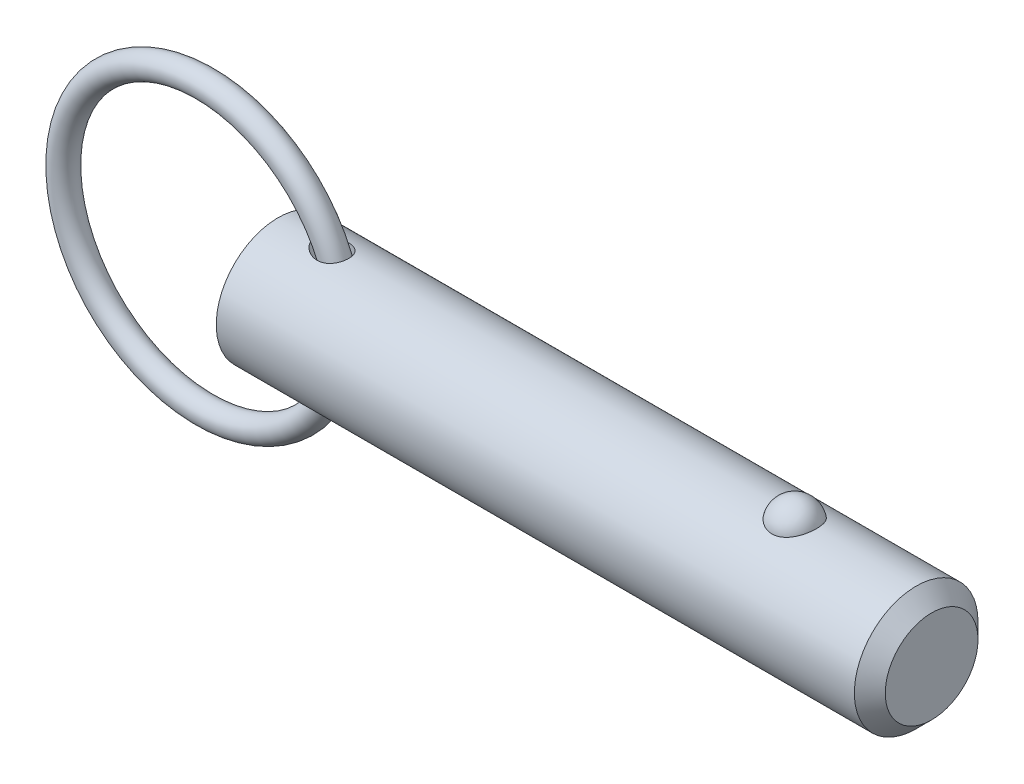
ISO-10303-21;
HEADER;
FILE_DESCRIPTION(('STEP AP214'),'2;1');
FILE_NAME('part.step','',(''),(''),'','','');
FILE_SCHEMA(('AUTOMOTIVE_DESIGN { 1 0 10303 214 1 1 1 1 }'));
ENDSEC;
DATA;
#1=APPLICATION_CONTEXT('core data for automotive mechanical design processes');
#2=APPLICATION_PROTOCOL_DEFINITION('international standard','automotive_design',2000,#1);
#3=PRODUCT_CONTEXT('',#1,'mechanical');
#4=PRODUCT('Part','Part','',(#3));
#5=PRODUCT_RELATED_PRODUCT_CATEGORY('part','',(#4));
#6=PRODUCT_DEFINITION_FORMATION('','',#4);
#7=PRODUCT_DEFINITION_CONTEXT('part definition',#1,'design');
#8=PRODUCT_DEFINITION('design','',#6,#7);
#9=PRODUCT_DEFINITION_SHAPE('','',#8);
#10=(LENGTH_UNIT() NAMED_UNIT(*) SI_UNIT(.MILLI.,.METRE.));
#11=(NAMED_UNIT(*) PLANE_ANGLE_UNIT() SI_UNIT($,.RADIAN.));
#12=(NAMED_UNIT(*) SI_UNIT($,.STERADIAN.) SOLID_ANGLE_UNIT());
#13=UNCERTAINTY_MEASURE_WITH_UNIT(LENGTH_MEASURE(1.E-05),#10,'distance_accuracy_value','');
#14=(GEOMETRIC_REPRESENTATION_CONTEXT(3) GLOBAL_UNCERTAINTY_ASSIGNED_CONTEXT((#13)) GLOBAL_UNIT_ASSIGNED_CONTEXT((#10,
#11,#12)) REPRESENTATION_CONTEXT('',''));
#15=CARTESIAN_POINT('',(0.,0.,0.));
#16=DIRECTION('',(0.,0.,1.));
#17=DIRECTION('',(1.,0.,0.));
#18=AXIS2_PLACEMENT_3D('',#15,#16,#17);
#19=CARTESIAN_POINT('',(-6.5973878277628,0.,0.));
#20=DIRECTION('',(0.,0.,1.));
#21=DIRECTION('',(1.,0.,0.));
#22=AXIS2_PLACEMENT_3D('',#19,#20,#21);
#23=TOROIDAL_SURFACE('',#22,12.7,1.111);
#24=CARTESIAN_POINT('',(7.21361217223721,0.,0.));
#25=VERTEX_POINT('',#24);
#26=VERTEX_LOOP('',#25);
#27=FACE_BOUND('',#26,.T.);
#28=ADVANCED_FACE('P0_F12',(#27),#23,.T.);
#29=CLOSED_SHELL('',(#28));
#30=MANIFOLD_SOLID_BREP('P0_B1',#29);
#31=CARTESIAN_POINT('',(0.,0.,0.));
#32=DIRECTION('',(1.,0.,0.));
#33=DIRECTION('',(0.,0.,-1.));
#34=AXIS2_PLACEMENT_3D('',#31,#32,#33);
#35=CYLINDRICAL_SURFACE('',#34,5.555);
#36=CARTESIAN_POINT('',(3.4079629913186,5.52646850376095,-0.562290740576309));
#37=CARTESIAN_POINT('',(3.45038002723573,5.51879026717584,-0.637753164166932));
#38=CARTESIAN_POINT('',(3.50032814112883,5.50998541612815,-0.708891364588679));
#39=CARTESIAN_POINT('',(3.61174203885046,5.49132550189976,-0.841353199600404));
#40=CARTESIAN_POINT('',(3.67323300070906,5.48146816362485,-0.902654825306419));
#41=CARTESIAN_POINT('',(3.80437942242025,5.46186986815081,-1.01449227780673));
#42=CARTESIAN_POINT('',(3.87396236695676,5.45212862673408,-1.06511378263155));
#43=CARTESIAN_POINT('',(4.01965973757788,5.43359578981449,-1.15594541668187));
#44=CARTESIAN_POINT('',(4.09577226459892,5.42480391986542,-1.19615855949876));
#45=CARTESIAN_POINT('',(4.26620236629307,5.40764958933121,-1.27165209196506));
#46=CARTESIAN_POINT('',(4.36143030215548,5.3996073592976,-1.30496908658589));
#47=CARTESIAN_POINT('',(4.55632904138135,5.38707461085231,-1.35578120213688));
#48=CARTESIAN_POINT('',(4.65600230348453,5.38258608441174,-1.37326745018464));
#49=CARTESIAN_POINT('',(4.85802759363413,5.37803111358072,-1.3910078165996));
#50=CARTESIAN_POINT('',(4.96039620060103,5.37800782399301,-1.39109376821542));
#51=CARTESIAN_POINT('',(5.16321961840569,5.38288845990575,-1.37209481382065));
#52=CARTESIAN_POINT('',(5.26367660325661,5.38778639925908,-1.3530331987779));
#53=CARTESIAN_POINT('',(5.44616808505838,5.40112654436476,-1.29866014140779));
#54=CARTESIAN_POINT('',(5.52893514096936,5.40904875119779,-1.26567968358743));
#55=CARTESIAN_POINT('',(5.68656142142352,5.4273273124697,-1.18484144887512));
#56=CARTESIAN_POINT('',(5.76142575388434,5.43768208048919,-1.13699336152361));
#57=CARTESIAN_POINT('',(5.8928378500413,5.45821422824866,-1.03362464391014));
#58=CARTESIAN_POINT('',(5.95048930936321,5.4682911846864,-0.979480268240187));
#59=CARTESIAN_POINT('',(6.05543937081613,5.48805232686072,-0.86188793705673));
#60=CARTESIAN_POINT('',(6.10274018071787,5.4977365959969,-0.798441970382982));
#61=CARTESIAN_POINT('',(6.18429732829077,5.51527779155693,-0.666351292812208));
#62=CARTESIAN_POINT('',(6.21893047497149,5.52318421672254,-0.597945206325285));
#63=CARTESIAN_POINT('',(6.27643902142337,5.53669785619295,-0.456146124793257));
#64=CARTESIAN_POINT('',(6.299314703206,5.54230512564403,-0.38275324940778));
#65=CARTESIAN_POINT('',(6.33280284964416,5.55061821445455,-0.232999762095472));
#66=CARTESIAN_POINT('',(6.34340498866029,5.55332159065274,-0.156636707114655));
#67=CARTESIAN_POINT('',(6.35208224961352,5.55552923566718,-0.00315477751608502));
#68=CARTESIAN_POINT('',(6.3501570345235,5.55503341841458,0.0739641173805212));
#69=CARTESIAN_POINT('',(6.33379320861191,5.55088854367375,0.227029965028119));
#70=CARTESIAN_POINT('',(6.31931424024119,5.54722931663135,0.302972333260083));
#71=CARTESIAN_POINT('',(6.27810810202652,5.53713917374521,0.451265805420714));
#72=CARTESIAN_POINT('',(6.25138106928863,5.53070828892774,0.52361694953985));
#73=CARTESIAN_POINT('',(6.18634700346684,5.51578851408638,0.662556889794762));
#74=CARTESIAN_POINT('',(6.14805666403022,5.50730259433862,0.729153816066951));
#75=CARTESIAN_POINT('',(6.0608417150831,5.4892059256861,0.854797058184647));
#76=CARTESIAN_POINT('',(6.01191805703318,5.47959527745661,0.913844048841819));
#77=CARTESIAN_POINT('',(5.90496974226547,5.46035411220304,1.0225462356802));
#78=CARTESIAN_POINT('',(5.84698163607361,5.45072382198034,1.07223745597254));
#79=CARTESIAN_POINT('',(5.72342907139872,5.43245016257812,1.16128533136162));
#80=CARTESIAN_POINT('',(5.65786492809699,5.42380675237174,1.20064241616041));
#81=CARTESIAN_POINT('',(5.52033184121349,5.40830592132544,1.26865612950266));
#82=CARTESIAN_POINT('',(5.44830127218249,5.40146883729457,1.2971923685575));
#83=CARTESIAN_POINT('',(5.30051649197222,5.39032432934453,1.34275086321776));
#84=CARTESIAN_POINT('',(5.22476137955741,5.38601752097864,1.35977031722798));
#85=CARTESIAN_POINT('',(5.06697568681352,5.38004503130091,1.3832203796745));
#86=CARTESIAN_POINT('',(4.98483834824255,5.37854992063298,1.38896799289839));
#87=CARTESIAN_POINT('',(4.82062075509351,5.37866467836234,1.38851901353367));
#88=CARTESIAN_POINT('',(4.73854053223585,5.38027567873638,1.38231806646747));
#89=CARTESIAN_POINT('',(4.56659703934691,5.38661928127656,1.35740374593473));
#90=CARTESIAN_POINT('',(4.47694676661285,5.39169506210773,1.33731128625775));
#91=CARTESIAN_POINT('',(4.30168169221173,5.40457769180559,1.28425210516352));
#92=CARTESIAN_POINT('',(4.2160714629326,5.41238755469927,1.25127117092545));
#93=CARTESIAN_POINT('',(4.04117722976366,5.43085841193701,1.16867508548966));
#94=CARTESIAN_POINT('',(3.95261220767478,5.44174460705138,1.11757796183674));
#95=CARTESIAN_POINT('',(3.78568183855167,5.46440376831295,1.00091858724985));
#96=CARTESIAN_POINT('',(3.70730710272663,5.47617590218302,0.935369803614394));
#97=CARTESIAN_POINT('',(3.5829937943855,5.49603821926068,0.809043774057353));
#98=CARTESIAN_POINT('',(3.5339020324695,5.50429522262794,0.751392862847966));
#99=CARTESIAN_POINT('',(3.44556991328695,5.51963490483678,0.628847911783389));
#100=CARTESIAN_POINT('',(3.4063138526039,5.52671944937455,0.56396565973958));
#101=CARTESIAN_POINT('',(3.34553998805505,5.5379053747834,0.439181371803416));
#102=CARTESIAN_POINT('',(3.32216705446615,5.5423057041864,0.380214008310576));
#103=CARTESIAN_POINT('',(3.2854368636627,5.54928356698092,0.259119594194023));
#104=CARTESIAN_POINT('',(3.27207322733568,5.5518622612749,0.196994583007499));
#105=CARTESIAN_POINT('',(3.25633559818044,5.5549036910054,0.0710541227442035));
#106=CARTESIAN_POINT('',(3.25400356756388,5.5553583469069,0.00723314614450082));
#107=CARTESIAN_POINT('',(3.26064251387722,5.55407150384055,-0.119787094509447));
#108=CARTESIAN_POINT('',(3.26961302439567,5.55233009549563,-0.182986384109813));
#109=CARTESIAN_POINT('',(3.29666795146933,5.54714559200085,-0.300518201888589));
#110=CARTESIAN_POINT('',(3.31373453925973,5.54389322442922,-0.355099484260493));
#111=CARTESIAN_POINT('',(3.35543396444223,5.53607951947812,-0.461174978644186));
#112=CARTESIAN_POINT('',(3.38007019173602,5.5315175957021,-0.512667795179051));
#113=CARTESIAN_POINT('',(3.4079629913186,5.52646850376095,-0.562290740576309));
#114=B_SPLINE_CURVE_WITH_KNOTS('',3,(#36,#37,#38,#39,#40,#41,#42,#43,#44,#45,#46,#47,#48,#49,
#50,#51,#52,#53,#54,#55,#56,#57,#58,#59,#60,#61,#62,#63,#64,#65,#66,#67,#68,#69,#70,#71,#72,#73,
#74,#75,#76,#77,#78,#79,#80,#81,#82,#83,#84,#85,#86,#87,#88,#89,#90,#91,#92,#93,#94,#95,#96,#97,
#98,#99,#100,#101,#102,#103,#104,#105,#106,#107,#108,#109,#110,#111,#112,#113),.UNSPECIFIED.,
.T.,.F.,(4,2,2,2,2,2,2,2,2,2,2,2,2,2,2,2,2,2,2,2,2,2,2,2,2,2,2,2,2,2,2,2,2,2,2,2,2,2,4),(0.,
0.260459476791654,0.521493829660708,0.780346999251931,1.03912513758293,1.34137402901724,
1.64379222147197,1.94913302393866,2.25410286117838,2.52092363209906,2.78757087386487,
3.0255756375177,3.26352958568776,3.49368251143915,3.72382991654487,3.95417080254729,
4.18451788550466,4.41560824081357,4.64669600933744,4.87745174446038,5.10818684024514,
5.33801446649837,5.56783253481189,5.80013729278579,6.03249854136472,6.27855081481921,
6.52469277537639,6.79963372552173,7.07487872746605,7.38193573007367,7.68870779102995,
7.91639390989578,8.14371416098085,8.33366541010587,8.52349549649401,8.71404708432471,
8.90459080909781,9.07578823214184,9.24706243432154),.UNSPECIFIED.);
#115=CARTESIAN_POINT('',(3.4079629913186,5.52646850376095,-0.562290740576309));
#116=VERTEX_POINT('',#115);
#117=EDGE_CURVE('P1_E40',#116,#116,#114,.T.);
#118=ORIENTED_EDGE('',*,*,#117,.T.);
#119=EDGE_LOOP('',(#118));
#120=FACE_BOUND('',#119,.T.);
#121=CARTESIAN_POINT('',(57.33125,0.,0.));
#122=DIRECTION('',(1.,0.,0.));
#123=DIRECTION('',(0.,0.,-1.));
#124=AXIS2_PLACEMENT_3D('',#121,#122,#123);
#125=CIRCLE('',#124,5.555);
#126=CARTESIAN_POINT('',(57.33125,0.,-5.555));
#127=VERTEX_POINT('',#126);
#128=EDGE_CURVE('P1_E25',#127,#127,#125,.T.);
#129=ORIENTED_EDGE('',*,*,#128,.F.);
#130=EDGE_LOOP('',(#129));
#131=FACE_BOUND('',#130,.T.);
#132=CARTESIAN_POINT('',(0.,0.,0.));
#133=DIRECTION('',(1.,0.,0.));
#134=DIRECTION('',(0.,0.,-1.));
#135=AXIS2_PLACEMENT_3D('',#132,#133,#134);
#136=CIRCLE('',#135,5.555);
#137=CARTESIAN_POINT('',(0.,0.,-5.555));
#138=VERTEX_POINT('',#137);
#139=EDGE_CURVE('P1_E9',#138,#138,#136,.T.);
#140=ORIENTED_EDGE('',*,*,#139,.T.);
#141=EDGE_LOOP('',(#140));
#142=FACE_BOUND('',#141,.T.);
#143=CARTESIAN_POINT('',(46.4186264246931,5.16741224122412,2.03859650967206));
#144=CARTESIAN_POINT('',(46.3129492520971,5.16740893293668,2.03859990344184));
#145=CARTESIAN_POINT('',(46.20729894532,5.17079470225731,2.03008306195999));
#146=CARTESIAN_POINT('',(45.9991419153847,5.18392795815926,1.9963072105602));
#147=CARTESIAN_POINT('',(45.8966344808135,5.19367399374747,1.97105201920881));
#148=CARTESIAN_POINT('',(45.6977710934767,5.21839168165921,1.90463997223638));
#149=CARTESIAN_POINT('',(45.6014064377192,5.23335573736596,1.86350622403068));
#150=CARTESIAN_POINT('',(45.4170804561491,5.26688076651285,1.76652592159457));
#151=CARTESIAN_POINT('',(45.3291207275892,5.28544242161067,1.71067657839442));
#152=CARTESIAN_POINT('',(45.1612654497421,5.32479845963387,1.58399959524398));
#153=CARTESIAN_POINT('',(45.0816656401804,5.34564089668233,1.5127954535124));
#154=CARTESIAN_POINT('',(44.9351290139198,5.38697258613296,1.3582858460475));
#155=CARTESIAN_POINT('',(44.868194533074,5.40746177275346,1.27497815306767));
#156=CARTESIAN_POINT('',(44.7456103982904,5.44694508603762,1.09440293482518));
#157=CARTESIAN_POINT('',(44.6905989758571,5.46583143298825,0.996677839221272));
#158=CARTESIAN_POINT('',(44.5969376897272,5.49908030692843,0.792961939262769));
#159=CARTESIAN_POINT('',(44.5582894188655,5.513442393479,0.686970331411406));
#160=CARTESIAN_POINT('',(44.4976807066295,5.536358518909,0.468019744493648));
#161=CARTESIAN_POINT('',(44.4759725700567,5.54482455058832,0.354981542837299));
#162=CARTESIAN_POINT('',(44.4506362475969,5.55473324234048,0.126595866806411));
#163=CARTESIAN_POINT('',(44.4470077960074,5.55617600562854,0.0112484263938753));
#164=CARTESIAN_POINT('',(44.4578817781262,5.55189984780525,-0.218011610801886));
#165=CARTESIAN_POINT('',(44.4723151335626,5.54620821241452,-0.33192800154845));
#166=CARTESIAN_POINT('',(44.518903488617,5.52828920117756,-0.555544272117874));
#167=CARTESIAN_POINT('',(44.5510588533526,5.5160616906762,-0.66524406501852));
#168=CARTESIAN_POINT('',(44.6324883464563,5.48630779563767,-0.877469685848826));
#169=CARTESIAN_POINT('',(44.6817816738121,5.4687754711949,-0.979987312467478));
#170=CARTESIAN_POINT('',(44.7964785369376,5.43024700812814,-1.1748697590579));
#171=CARTESIAN_POINT('',(44.8618831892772,5.4092506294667,-1.26723387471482));
#172=CARTESIAN_POINT('',(45.0075712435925,5.36600927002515,-1.4394013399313));
#173=CARTESIAN_POINT('',(45.0878859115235,5.34376173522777,-1.51917763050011));
#174=CARTESIAN_POINT('',(45.2614520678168,5.30057971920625,-1.66360338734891));
#175=CARTESIAN_POINT('',(45.354702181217,5.27964509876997,-1.72825445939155));
#176=CARTESIAN_POINT('',(45.5493939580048,5.24205250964,-1.83909478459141));
#177=CARTESIAN_POINT('',(45.6505900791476,5.22530519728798,-1.88568407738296));
#178=CARTESIAN_POINT('',(45.8601552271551,5.19750919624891,-1.96100802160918));
#179=CARTESIAN_POINT('',(45.9685215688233,5.1864583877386,-1.98974931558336));
#180=CARTESIAN_POINT('',(46.1834989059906,5.17184410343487,-2.02742262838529));
#181=CARTESIAN_POINT('',(46.289925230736,5.16793282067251,-2.03727608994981));
#182=CARTESIAN_POINT('',(46.5029925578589,5.16698995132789,-2.03966777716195));
#183=CARTESIAN_POINT('',(46.6096335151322,5.16995704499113,-2.03220932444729));
#184=CARTESIAN_POINT('',(46.8167730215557,5.18222383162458,-2.00071170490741));
#185=CARTESIAN_POINT('',(46.9173599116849,5.19133213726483,-1.97717337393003));
#186=CARTESIAN_POINT('',(47.1130141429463,5.21467637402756,-1.91475248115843));
#187=CARTESIAN_POINT('',(47.2080810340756,5.22891272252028,-1.8758686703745));
#188=CARTESIAN_POINT('',(47.3923711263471,5.26137066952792,-1.78282713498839));
#189=CARTESIAN_POINT('',(47.4814190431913,5.27967329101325,-1.72835124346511));
#190=CARTESIAN_POINT('',(47.6492880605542,5.3181741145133,-1.6059748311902));
#191=CARTESIAN_POINT('',(47.7281068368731,5.33837274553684,-1.53807126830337));
#192=CARTESIAN_POINT('',(47.8775156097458,5.37968287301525,-1.38688970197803));
#193=CARTESIAN_POINT('',(47.9475058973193,5.40079011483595,-1.30301744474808));
#194=CARTESIAN_POINT('',(48.0730125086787,5.44074401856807,-1.12458170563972));
#195=CARTESIAN_POINT('',(48.1285262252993,5.4595902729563,-1.03001630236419));
#196=CARTESIAN_POINT('',(48.2255507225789,5.49369849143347,-0.829439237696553));
#197=CARTESIAN_POINT('',(48.2665483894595,5.50882422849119,-0.723155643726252));
#198=CARTESIAN_POINT('',(48.3311250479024,5.53310911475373,-0.504772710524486));
#199=CARTESIAN_POINT('',(48.3547036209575,5.54226812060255,-0.392673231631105));
#200=CARTESIAN_POINT('',(48.384013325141,5.55370358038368,-0.165459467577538));
#201=CARTESIAN_POINT('',(48.3896884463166,5.55595843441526,-0.050336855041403));
#202=CARTESIAN_POINT('',(48.382916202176,5.55329317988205,0.179288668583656));
#203=CARTESIAN_POINT('',(48.3704690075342,5.54837313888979,0.293791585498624));
#204=CARTESIAN_POINT('',(48.3277798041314,5.53189037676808,0.518526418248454));
#205=CARTESIAN_POINT('',(48.297598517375,5.5203503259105,0.628771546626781));
#206=CARTESIAN_POINT('',(48.2200962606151,5.49182453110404,0.84231815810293));
#207=CARTESIAN_POINT('',(48.1727743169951,5.47483847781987,0.945619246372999));
#208=CARTESIAN_POINT('',(48.0617204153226,5.43710633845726,1.14281571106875));
#209=CARTESIAN_POINT('',(47.9979215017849,5.41634501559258,1.23667048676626));
#210=CARTESIAN_POINT('',(47.8553577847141,5.37334572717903,1.41185243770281));
#211=CARTESIAN_POINT('',(47.7765932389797,5.35110778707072,1.49317982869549));
#212=CARTESIAN_POINT('',(47.6064234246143,5.30779474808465,1.64049162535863));
#213=CARTESIAN_POINT('',(47.5151002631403,5.28671324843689,1.7065687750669));
#214=CARTESIAN_POINT('',(47.3217390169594,5.2480485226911,1.82201372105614));
#215=CARTESIAN_POINT('',(47.2197005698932,5.23046541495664,1.87138095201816));
#216=CARTESIAN_POINT('',(47.0036187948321,5.20042692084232,1.95335298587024));
#217=CARTESIAN_POINT('',(46.889260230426,5.18820192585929,1.98521734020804));
#218=CARTESIAN_POINT('',(46.6561307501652,5.17169804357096,2.02783294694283));
#219=CARTESIAN_POINT('',(46.5373616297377,5.16741595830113,2.03859269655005));
#220=CARTESIAN_POINT('',(46.4186264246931,5.16741224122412,2.03859650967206));
#221=B_SPLINE_CURVE_WITH_KNOTS('',3,(#143,#144,#145,#146,#147,#148,#149,#150,#151,#152,#153,
#154,#155,#156,#157,#158,#159,#160,#161,#162,#163,#164,#165,#166,#167,#168,#169,#170,#171,#172,
#173,#174,#175,#176,#177,#178,#179,#180,#181,#182,#183,#184,#185,#186,#187,#188,#189,#190,#191,
#192,#193,#194,#195,#196,#197,#198,#199,#200,#201,#202,#203,#204,#205,#206,#207,#208,#209,#210,
#211,#212,#213,#214,#215,#216,#217,#218,#219,#220),.UNSPECIFIED.,.T.,.F.,(4,2,2,2,2,2,2,2,2,2,2,
2,2,2,2,2,2,2,2,2,2,2,2,2,2,2,2,2,2,2,2,2,2,2,2,2,2,2,4),(0.,0.316595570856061,
0.633118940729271,0.949183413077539,1.26530783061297,1.59030762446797,1.91536729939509,
2.25495824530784,2.59458224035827,2.93917283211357,3.28375835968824,3.62703002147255,
3.97030875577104,4.31397329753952,4.65766166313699,5.00207904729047,5.34645984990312,
5.68270547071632,6.01882587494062,6.33808403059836,6.65728093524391,6.96696376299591,
7.27667180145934,7.59321535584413,7.90983070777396,8.24210387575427,8.57443684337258,
8.91755896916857,9.26068933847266,9.60489211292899,9.94909164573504,10.2921194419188,
10.6351667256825,10.9796305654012,11.3240884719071,11.6663928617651,12.0087088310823,
12.3645679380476,12.7202837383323),.UNSPECIFIED.);
#222=CARTESIAN_POINT('',(46.4186264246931,5.16741224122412,2.03859650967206));
#223=VERTEX_POINT('',#222);
#224=EDGE_CURVE('P1_E34',#223,#223,#221,.T.);
#225=ORIENTED_EDGE('',*,*,#224,.T.);
#226=EDGE_LOOP('',(#225));
#227=FACE_BOUND('',#226,.T.);
#228=CARTESIAN_POINT('',(3.4079629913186,-5.52646850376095,-0.562290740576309));
#229=CARTESIAN_POINT('',(3.37716927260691,-5.53204268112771,-0.50750716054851));
#230=CARTESIAN_POINT('',(3.35034276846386,-5.53702335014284,-0.450440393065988));
#231=CARTESIAN_POINT('',(3.30606625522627,-5.54534377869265,-0.332655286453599));
#232=CARTESIAN_POINT('',(3.28860803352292,-5.5486849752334,-0.27194019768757));
#233=CARTESIAN_POINT('',(3.2642120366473,-5.55337514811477,-0.148013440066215));
#234=CARTESIAN_POINT('',(3.25732647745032,-5.55471423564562,-0.0847909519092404));
#235=CARTESIAN_POINT('',(3.25480623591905,-5.5552029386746,0.0418913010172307));
#236=CARTESIAN_POINT('',(3.25917102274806,-5.55435265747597,0.105351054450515));
#237=CARTESIAN_POINT('',(3.27824306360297,-5.55067444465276,0.227039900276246));
#238=CARTESIAN_POINT('',(3.29237198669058,-5.54795714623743,0.285365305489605));
#239=CARTESIAN_POINT('',(3.32941044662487,-5.54094262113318,0.399033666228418));
#240=CARTESIAN_POINT('',(3.35232235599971,-5.53664496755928,0.454375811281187));
#241=CARTESIAN_POINT('',(3.40768868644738,-5.52648234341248,0.565099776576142));
#242=CARTESIAN_POINT('',(3.44072521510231,-5.52052470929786,0.620179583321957));
#243=CARTESIAN_POINT('',(3.51400705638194,-5.50771567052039,0.725188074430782));
#244=CARTESIAN_POINT('',(3.55425830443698,-5.50086353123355,0.775112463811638));
#245=CARTESIAN_POINT('',(3.66122818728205,-5.48337209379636,0.891977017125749));
#246=CARTESIAN_POINT('',(3.73142715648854,-5.47248221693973,0.955709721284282));
#247=CARTESIAN_POINT('',(3.88137100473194,-5.45112279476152,1.07085228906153));
#248=CARTESIAN_POINT('',(3.96113047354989,-5.44065392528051,1.12224294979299));
#249=CARTESIAN_POINT('',(4.12858826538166,-5.42121387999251,1.2126934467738));
#250=CARTESIAN_POINT('',(4.21635930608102,-5.41225908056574,1.25162207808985));
#251=CARTESIAN_POINT('',(4.39702156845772,-5.39704895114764,1.31566440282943));
#252=CARTESIAN_POINT('',(4.48991226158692,-5.39079334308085,1.34077951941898));
#253=CARTESIAN_POINT('',(4.68604255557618,-5.38154547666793,1.37745897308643));
#254=CARTESIAN_POINT('',(4.78952677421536,-5.37884317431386,1.38782444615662));
#255=CARTESIAN_POINT('',(4.9967070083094,-5.3783992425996,1.38955482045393));
#256=CARTESIAN_POINT('',(5.10040282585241,-5.380654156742,1.380932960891));
#257=CARTESIAN_POINT('',(5.29344112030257,-5.3896561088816,1.34533259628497));
#258=CARTESIAN_POINT('',(5.38316618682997,-5.39591960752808,1.32032381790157));
#259=CARTESIAN_POINT('',(5.55593681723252,-5.41176992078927,1.25376768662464));
#260=CARTESIAN_POINT('',(5.63898852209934,-5.42135363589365,1.2122357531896));
#261=CARTESIAN_POINT('',(5.78518175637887,-5.4411584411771,1.1197110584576));
#262=CARTESIAN_POINT('',(5.84951468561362,-5.45115126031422,1.07054233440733));
#263=CARTESIAN_POINT('',(5.96832363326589,-5.47143247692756,0.961516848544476));
#264=CARTESIAN_POINT('',(6.02280238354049,-5.48172079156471,0.901663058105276));
#265=CARTESIAN_POINT('',(6.11773365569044,-5.50082367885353,0.776380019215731));
#266=CARTESIAN_POINT('',(6.15876077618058,-5.50968670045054,0.71139212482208));
#267=CARTESIAN_POINT('',(6.22940016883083,-5.52555592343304,0.57527808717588));
#268=CARTESIAN_POINT('',(6.25901321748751,-5.53256225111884,0.504152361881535));
#269=CARTESIAN_POINT('',(6.30603044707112,-5.54392803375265,0.358090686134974));
#270=CARTESIAN_POINT('',(6.32348246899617,-5.54829785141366,0.283170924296));
#271=CARTESIAN_POINT('',(6.34598368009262,-5.5539654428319,0.131376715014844));
#272=CARTESIAN_POINT('',(6.35103253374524,-5.55526313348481,0.0545022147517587));
#273=CARTESIAN_POINT('',(6.34861245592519,-5.55464639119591,-0.0993401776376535));
#274=CARTESIAN_POINT('',(6.34109421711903,-5.5527193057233,-0.176307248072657));
#275=CARTESIAN_POINT('',(6.31360904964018,-5.54583593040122,-0.327847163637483));
#276=CARTESIAN_POINT('',(6.29364207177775,-5.54087962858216,-0.402419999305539));
#277=CARTESIAN_POINT('',(6.24170966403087,-5.52847553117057,-0.547041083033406));
#278=CARTESIAN_POINT('',(6.20974488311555,-5.52102787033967,-0.617089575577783));
#279=CARTESIAN_POINT('',(6.13458425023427,-5.5044595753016,-0.750655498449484));
#280=CARTESIAN_POINT('',(6.09138916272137,-5.49533905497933,-0.814173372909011));
#281=CARTESIAN_POINT('',(5.99508306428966,-5.47647644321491,-0.932642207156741));
#282=CARTESIAN_POINT('',(5.94201288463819,-5.46673701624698,-0.98762679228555));
#283=CARTESIAN_POINT('',(5.82732079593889,-5.4476756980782,-1.08787197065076));
#284=CARTESIAN_POINT('',(5.76569959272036,-5.43835377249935,-1.133133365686));
#285=CARTESIAN_POINT('',(5.63545565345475,-5.42108746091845,-1.2130627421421));
#286=CARTESIAN_POINT('',(5.56680798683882,-5.41314827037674,-1.24769112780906));
#287=CARTESIAN_POINT('',(5.42470366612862,-5.39946749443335,-1.30562834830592));
#288=CARTESIAN_POINT('',(5.35124627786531,-5.39372624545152,-1.32893545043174));
#289=CARTESIAN_POINT('',(5.19834649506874,-5.38471871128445,-1.36498831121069));
#290=CARTESIAN_POINT('',(5.11878242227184,-5.38156800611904,-1.37724301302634));
#291=CARTESIAN_POINT('',(4.95867408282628,-5.37830368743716,-1.38993264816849));
#292=CARTESIAN_POINT('',(4.87812945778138,-5.37819121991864,-1.39036312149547));
#293=CARTESIAN_POINT('',(4.70952450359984,-5.38096665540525,-1.37958681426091));
#294=CARTESIAN_POINT('',(4.62154757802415,-5.38416579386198,-1.36717293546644));
#295=CARTESIAN_POINT('',(4.44844201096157,-5.39350862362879,-1.32983172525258));
#296=CARTESIAN_POINT('',(4.36331534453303,-5.39965431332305,-1.30489590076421));
#297=CARTESIAN_POINT('',(4.18705584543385,-5.41508127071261,-1.23943340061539));
#298=CARTESIAN_POINT('',(4.09653169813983,-5.42466147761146,-1.19732979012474));
#299=CARTESIAN_POINT('',(3.92355621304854,-5.44542654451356,-1.09903394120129));
#300=CARTESIAN_POINT('',(3.84111059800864,-5.45661252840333,-1.0428318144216));
#301=CARTESIAN_POINT('',(3.69303712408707,-5.47835672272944,-0.921492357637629));
#302=CARTESIAN_POINT('',(3.62661543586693,-5.4888999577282,-0.857326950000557));
#303=CARTESIAN_POINT('',(3.50663841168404,-5.50887375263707,-0.71781545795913));
#304=CARTESIAN_POINT('',(3.45304856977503,-5.51830726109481,-0.642500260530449));
#305=CARTESIAN_POINT('',(3.4079629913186,-5.52646850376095,-0.562290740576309));
#306=B_SPLINE_CURVE_WITH_KNOTS('',3,(#228,#229,#230,#231,#232,#233,#234,#235,#236,#237,#238,
#239,#240,#241,#242,#243,#244,#245,#246,#247,#248,#249,#250,#251,#252,#253,#254,#255,#256,#257,
#258,#259,#260,#261,#262,#263,#264,#265,#266,#267,#268,#269,#270,#271,#272,#273,#274,#275,#276,
#277,#278,#279,#280,#281,#282,#283,#284,#285,#286,#287,#288,#289,#290,#291,#292,#293,#294,#295,
#296,#297,#298,#299,#300,#301,#302,#303,#304,#305),.UNSPECIFIED.,.T.,.F.,(4,2,2,2,2,2,2,2,2,2,2,
2,2,2,2,2,2,2,2,2,2,2,2,2,2,2,2,2,2,2,2,2,2,2,2,2,2,2,4),(0.,0.189054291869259,
0.377942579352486,0.567760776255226,0.757570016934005,0.937004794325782,1.11648807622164,
1.30929480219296,1.50226088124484,1.78704908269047,2.07227755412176,2.3604171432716,
2.64852704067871,2.95892962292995,3.26911584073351,3.5475451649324,3.82571526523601,
4.06921935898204,4.31265584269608,4.54364944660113,4.77462733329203,5.00469135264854,
5.234761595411,5.46573664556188,5.6967126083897,5.92767607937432,6.15862383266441,
6.38863707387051,6.61863134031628,6.84947196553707,7.08034790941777,7.32103794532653,
7.56181876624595,7.82747997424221,8.09332161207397,8.39289891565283,8.6926869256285,
8.97023931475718,9.24703674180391),.UNSPECIFIED.);
#307=CARTESIAN_POINT('',(3.4079629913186,-5.52646850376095,-0.562290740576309));
#308=VERTEX_POINT('',#307);
#309=EDGE_CURVE('P1_E17',#308,#308,#306,.T.);
#310=ORIENTED_EDGE('',*,*,#309,.T.);
#311=EDGE_LOOP('',(#310));
#312=FACE_BOUND('',#311,.T.);
#313=ADVANCED_FACE('P1_F13',(#120,#131,#142,#227,#312),#35,.T.);
#314=CARTESIAN_POINT('',(0.,0.,0.));
#315=DIRECTION('',(-1.,0.,0.));
#316=DIRECTION('',(0.,0.,1.));
#317=AXIS2_PLACEMENT_3D('',#314,#315,#316);
#318=PLANE('',#317);
#319=ORIENTED_EDGE('',*,*,#139,.F.);
#320=EDGE_LOOP('',(#319));
#321=FACE_BOUND('',#320,.T.);
#322=ADVANCED_FACE('P1_F15',(#321),#318,.T.);
#323=CARTESIAN_POINT('',(58.72,0.,0.));
#324=DIRECTION('',(-1.,0.,0.));
#325=DIRECTION('',(0.,0.,1.));
#326=AXIS2_PLACEMENT_3D('',#323,#324,#325);
#327=CONICAL_SURFACE('',#326,4.16625000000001,0.785398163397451);
#328=ORIENTED_EDGE('',*,*,#128,.T.);
#329=EDGE_LOOP('',(#328));
#330=FACE_BOUND('',#329,.T.);
#331=CARTESIAN_POINT('',(58.72,0.,0.));
#332=DIRECTION('',(1.,0.,0.));
#333=DIRECTION('',(0.,0.,-1.));
#334=AXIS2_PLACEMENT_3D('',#331,#332,#333);
#335=CIRCLE('',#334,4.16625000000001);
#336=CARTESIAN_POINT('',(58.72,0.,-4.16625000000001));
#337=VERTEX_POINT('',#336);
#338=EDGE_CURVE('P1_E30',#337,#337,#335,.T.);
#339=ORIENTED_EDGE('',*,*,#338,.F.);
#340=EDGE_LOOP('',(#339));
#341=FACE_BOUND('',#340,.T.);
#342=ADVANCED_FACE('P1_F55',(#330,#341),#327,.T.);
#343=CARTESIAN_POINT('',(58.72,4.16625000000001,0.));
#344=DIRECTION('',(1.,0.,0.));
#345=DIRECTION('',(0.,0.,-1.));
#346=AXIS2_PLACEMENT_3D('',#343,#344,#345);
#347=PLANE('',#346);
#348=ORIENTED_EDGE('',*,*,#338,.T.);
#349=EDGE_LOOP('',(#348));
#350=FACE_BOUND('',#349,.T.);
#351=ADVANCED_FACE('P1_F51',(#350),#347,.T.);
#352=CARTESIAN_POINT('',(46.4186264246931,4.9995,0.));
#353=DIRECTION('',(-1.,0.,0.));
#354=DIRECTION('',(0.,1.,0.));
#355=AXIS2_PLACEMENT_3D('',#352,#353,#354);
#356=SPHERICAL_SURFACE('',#355,2.0455);
#357=ORIENTED_EDGE('',*,*,#224,.F.);
#358=EDGE_LOOP('',(#357));
#359=FACE_BOUND('',#358,.T.);
#360=ADVANCED_FACE('P1_F46',(#359),#356,.T.);
#361=CARTESIAN_POINT('',(-6.59738782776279,0.,0.));
#362=DIRECTION('',(0.,0.,1.));
#363=DIRECTION('',(1.,0.,0.));
#364=AXIS2_PLACEMENT_3D('',#361,#362,#363);
#365=TOROIDAL_SURFACE('',#364,12.7,1.38875);
#366=ORIENTED_EDGE('',*,*,#309,.F.);
#367=EDGE_LOOP('',(#366));
#368=FACE_BOUND('',#367,.T.);
#369=ORIENTED_EDGE('',*,*,#117,.F.);
#370=EDGE_LOOP('',(#369));
#371=FACE_BOUND('',#370,.T.);
#372=ADVANCED_FACE('P1_F50',(#368,#371),#365,.F.);
#373=CLOSED_SHELL('',(#313,#322,#342,#351,#360,#372));
#374=MANIFOLD_SOLID_BREP('P1_B1',#373);
#375=ADVANCED_BREP_SHAPE_REPRESENTATION('',(#18,#30,#374),#14);
#376=SHAPE_DEFINITION_REPRESENTATION(#9,#375);
ENDSEC;
END-ISO-10303-21;
